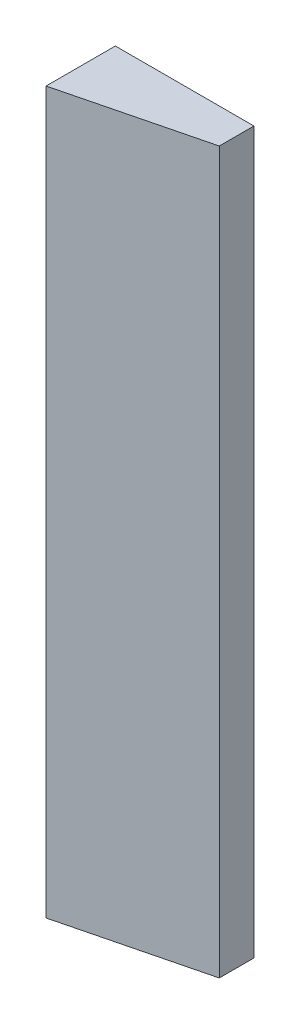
from build123d import *


with BuildPart() as part:
    # Sketch1 → Sloping_support_face section 0
    with BuildSketch(Plane.YZ):
        with BuildLine():
            Line((-165.1, -158.75), (165.1, -158.75))
            Line((165.1, -158.75), (165.1, -127))
            Line((165.1, -127), (-165.1, -127))
            Line((-165.1, -127), (-165.1, -158.75))
        make_face()
    # Sketch2 → Sloping_support_face section 1
    with BuildSketch(Plane.YZ.offset(63.5)):
        with BuildLine():
            Line((-165.1, -158.75), (165.1, -158.75))
            Line((165.1, -158.75), (165.1, -142.875))
            Line((165.1, -142.875), (-165.1, -142.875))
            Line((-165.1, -142.875), (-165.1, -158.75))
        make_face()
    loft()


solid = part.part
